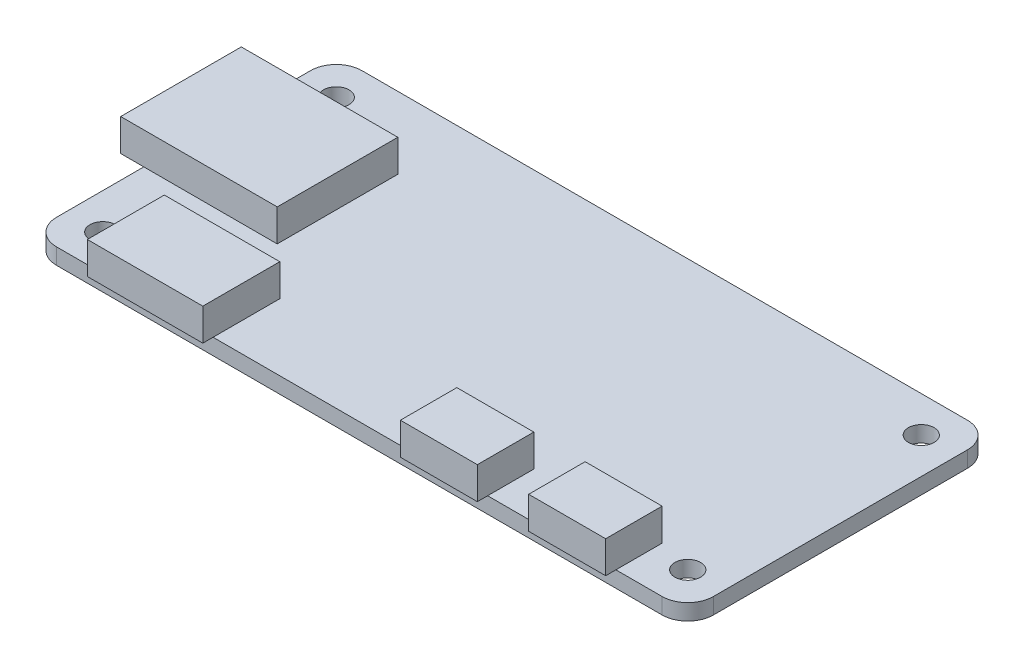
ISO-10303-21;
HEADER;
FILE_DESCRIPTION(('STEP AP214'),'2;1');
FILE_NAME('part.step','',(''),(''),'','','');
FILE_SCHEMA(('AUTOMOTIVE_DESIGN { 1 0 10303 214 1 1 1 1 }'));
ENDSEC;
DATA;
#1=APPLICATION_CONTEXT('core data for automotive mechanical design processes');
#2=APPLICATION_PROTOCOL_DEFINITION('international standard','automotive_design',2000,#1);
#3=PRODUCT_CONTEXT('',#1,'mechanical');
#4=PRODUCT('Part','Part','',(#3));
#5=PRODUCT_RELATED_PRODUCT_CATEGORY('part','',(#4));
#6=PRODUCT_DEFINITION_FORMATION('','',#4);
#7=PRODUCT_DEFINITION_CONTEXT('part definition',#1,'design');
#8=PRODUCT_DEFINITION('design','',#6,#7);
#9=PRODUCT_DEFINITION_SHAPE('','',#8);
#10=(LENGTH_UNIT() NAMED_UNIT(*) SI_UNIT(.MILLI.,.METRE.));
#11=(NAMED_UNIT(*) PLANE_ANGLE_UNIT() SI_UNIT($,.RADIAN.));
#12=(NAMED_UNIT(*) SI_UNIT($,.STERADIAN.) SOLID_ANGLE_UNIT());
#13=UNCERTAINTY_MEASURE_WITH_UNIT(LENGTH_MEASURE(1.E-05),#10,'distance_accuracy_value','');
#14=(GEOMETRIC_REPRESENTATION_CONTEXT(3) GLOBAL_UNCERTAINTY_ASSIGNED_CONTEXT((#13)) GLOBAL_UNIT_ASSIGNED_CONTEXT((#10,
#11,#12)) REPRESENTATION_CONTEXT('',''));
#15=CARTESIAN_POINT('',(0.,0.,0.));
#16=DIRECTION('',(0.,0.,1.));
#17=DIRECTION('',(1.,0.,0.));
#18=AXIS2_PLACEMENT_3D('',#15,#16,#17);
#19=CARTESIAN_POINT('',(2.54,1.5875,-2.54));
#20=DIRECTION('',(0.,-1.,0.));
#21=DIRECTION('',(0.,0.,-1.));
#22=AXIS2_PLACEMENT_3D('',#19,#20,#21);
#23=PLANE('',#22);
#24=CARTESIAN_POINT('',(3.556,1.5875,-26.67));
#25=DIRECTION('',(0.,1.,0.));
#26=DIRECTION('',(0.,0.,1.));
#27=AXIS2_PLACEMENT_3D('',#24,#25,#26);
#28=CIRCLE('',#27,1.27);
#29=CARTESIAN_POINT('',(3.556,1.5875,-25.4));
#30=VERTEX_POINT('',#29);
#31=EDGE_CURVE('E364',#30,#30,#28,.T.);
#32=ORIENTED_EDGE('',*,*,#31,.F.);
#33=EDGE_LOOP('',(#32));
#34=FACE_BOUND('',#33,.T.);
#35=CARTESIAN_POINT('',(3.556,1.5875,-3.556));
#36=DIRECTION('',(0.,1.,0.));
#37=DIRECTION('',(0.,0.,1.));
#38=AXIS2_PLACEMENT_3D('',#35,#36,#37);
#39=CIRCLE('',#38,1.27);
#40=CARTESIAN_POINT('',(3.556,1.5875,-2.286));
#41=VERTEX_POINT('',#40);
#42=EDGE_CURVE('E358',#41,#41,#39,.T.);
#43=ORIENTED_EDGE('',*,*,#42,.F.);
#44=EDGE_LOOP('',(#43));
#45=FACE_BOUND('',#44,.T.);
#46=CARTESIAN_POINT('',(61.468,1.5875,-3.556));
#47=DIRECTION('',(0.,1.,0.));
#48=DIRECTION('',(0.,0.,1.));
#49=AXIS2_PLACEMENT_3D('',#46,#47,#48);
#50=CIRCLE('',#49,1.26999999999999);
#51=CARTESIAN_POINT('',(61.468,1.5875,-2.28600000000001));
#52=VERTEX_POINT('',#51);
#53=EDGE_CURVE('E352',#52,#52,#50,.T.);
#54=ORIENTED_EDGE('',*,*,#53,.F.);
#55=EDGE_LOOP('',(#54));
#56=FACE_BOUND('',#55,.T.);
#57=CARTESIAN_POINT('',(61.468,1.5875,-26.67));
#58=DIRECTION('',(0.,1.,0.));
#59=DIRECTION('',(0.,0.,1.));
#60=AXIS2_PLACEMENT_3D('',#57,#58,#59);
#61=CIRCLE('',#60,1.26999999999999);
#62=CARTESIAN_POINT('',(61.468,1.5875,-25.4));
#63=VERTEX_POINT('',#62);
#64=EDGE_CURVE('E346',#63,#63,#61,.T.);
#65=ORIENTED_EDGE('',*,*,#64,.F.);
#66=EDGE_LOOP('',(#65));
#67=FACE_BOUND('',#66,.T.);
#68=DIRECTION('',(-1.,0.,0.));
#69=VECTOR('',#68,1.);
#70=CARTESIAN_POINT('',(13.208,1.5875,-23.114));
#71=LINE('',#70,#69);
#72=CARTESIAN_POINT('',(13.208,1.5875,-23.114));
#73=VERTEX_POINT('',#72);
#74=CARTESIAN_POINT('',(0.,1.5875,-23.114));
#75=VERTEX_POINT('',#74);
#76=EDGE_CURVE('E49',#73,#75,#71,.T.);
#77=ORIENTED_EDGE('',*,*,#76,.F.);
#78=DIRECTION('',(0.,0.,-1.));
#79=VECTOR('',#78,1.);
#80=CARTESIAN_POINT('',(13.208,1.5875,-23.114));
#81=LINE('',#80,#79);
#82=CARTESIAN_POINT('',(13.208,1.5875,-11.176));
#83=VERTEX_POINT('',#82);
#84=EDGE_CURVE('E54',#83,#73,#81,.T.);
#85=ORIENTED_EDGE('',*,*,#84,.F.);
#86=DIRECTION('',(1.,0.,0.));
#87=VECTOR('',#86,1.);
#88=CARTESIAN_POINT('',(13.208,1.5875,-11.176));
#89=LINE('',#88,#87);
#90=CARTESIAN_POINT('',(0.,1.5875,-11.176));
#91=VERTEX_POINT('',#90);
#92=EDGE_CURVE('E819',#91,#83,#89,.T.);
#93=ORIENTED_EDGE('',*,*,#92,.F.);
#94=DIRECTION('',(0.,0.,1.));
#95=VECTOR('',#94,1.);
#96=CARTESIAN_POINT('',(0.,1.5875,-2.54000000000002));
#97=LINE('',#96,#95);
#98=CARTESIAN_POINT('',(0.,1.5875,-2.54000000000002));
#99=VERTEX_POINT('',#98);
#100=EDGE_CURVE('E391',#91,#99,#97,.T.);
#101=ORIENTED_EDGE('',*,*,#100,.T.);
#102=CARTESIAN_POINT('',(2.54,1.5875,-2.54));
#103=DIRECTION('',(0.,1.,0.));
#104=DIRECTION('',(0.,0.,-1.));
#105=AXIS2_PLACEMENT_3D('',#102,#103,#104);
#106=CIRCLE('',#105,2.54);
#107=CARTESIAN_POINT('',(2.54000000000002,1.5875,0.));
#108=VERTEX_POINT('',#107);
#109=EDGE_CURVE('E370',#99,#108,#106,.T.);
#110=ORIENTED_EDGE('',*,*,#109,.T.);
#111=DIRECTION('',(1.,0.,0.));
#112=VECTOR('',#111,1.);
#113=CARTESIAN_POINT('',(2.54000000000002,1.5875,0.));
#114=LINE('',#113,#112);
#115=CARTESIAN_POINT('',(6.604,1.5875,0.));
#116=VERTEX_POINT('',#115);
#117=EDGE_CURVE('E375',#108,#116,#114,.T.);
#118=ORIENTED_EDGE('',*,*,#117,.T.);
#119=DIRECTION('',(0.,0.,1.));
#120=VECTOR('',#119,1.);
#121=CARTESIAN_POINT('',(6.604,1.5875,-6.604));
#122=LINE('',#121,#120);
#123=CARTESIAN_POINT('',(6.604,1.5875,-6.604));
#124=VERTEX_POINT('',#123);
#125=EDGE_CURVE('E243',#124,#116,#122,.T.);
#126=ORIENTED_EDGE('',*,*,#125,.F.);
#127=DIRECTION('',(-1.,0.,0.));
#128=VECTOR('',#127,1.);
#129=CARTESIAN_POINT('',(6.604,1.5875,-6.604));
#130=LINE('',#129,#128);
#131=CARTESIAN_POINT('',(18.034,1.5875,-6.604));
#132=VERTEX_POINT('',#131);
#133=EDGE_CURVE('E253',#132,#124,#130,.T.);
#134=ORIENTED_EDGE('',*,*,#133,.F.);
#135=DIRECTION('',(0.,0.,-1.));
#136=VECTOR('',#135,1.);
#137=CARTESIAN_POINT('',(18.034,1.5875,-6.604));
#138=LINE('',#137,#136);
#139=CARTESIAN_POINT('',(18.034,1.5875,0.));
#140=VERTEX_POINT('',#139);
#141=EDGE_CURVE('E263',#140,#132,#138,.T.);
#142=ORIENTED_EDGE('',*,*,#141,.F.);
#143=CARTESIAN_POINT('',(37.592,1.5875,0.));
#144=VERTEX_POINT('',#143);
#145=EDGE_CURVE('E380',#140,#144,#114,.T.);
#146=ORIENTED_EDGE('',*,*,#145,.T.);
#147=DIRECTION('',(0.,0.,1.));
#148=VECTOR('',#147,1.);
#149=CARTESIAN_POINT('',(37.592,1.5875,-4.572));
#150=LINE('',#149,#148);
#151=CARTESIAN_POINT('',(37.592,1.5875,-4.572));
#152=VERTEX_POINT('',#151);
#153=EDGE_CURVE('E292',#152,#144,#150,.T.);
#154=ORIENTED_EDGE('',*,*,#153,.F.);
#155=DIRECTION('',(-1.,0.,0.));
#156=VECTOR('',#155,1.);
#157=CARTESIAN_POINT('',(37.592,1.5875,-4.572));
#158=LINE('',#157,#156);
#159=CARTESIAN_POINT('',(45.212,1.5875,-4.572));
#160=VERTEX_POINT('',#159);
#161=EDGE_CURVE('E285',#160,#152,#158,.T.);
#162=ORIENTED_EDGE('',*,*,#161,.F.);
#163=DIRECTION('',(0.,0.,-1.));
#164=VECTOR('',#163,1.);
#165=CARTESIAN_POINT('',(45.212,1.5875,-4.572));
#166=LINE('',#165,#164);
#167=CARTESIAN_POINT('',(45.212,1.5875,0.));
#168=VERTEX_POINT('',#167);
#169=EDGE_CURVE('E297',#168,#160,#166,.T.);
#170=ORIENTED_EDGE('',*,*,#169,.F.);
#171=CARTESIAN_POINT('',(50.292,1.5875,0.));
#172=VERTEX_POINT('',#171);
#173=EDGE_CURVE('E460',#168,#172,#114,.T.);
#174=ORIENTED_EDGE('',*,*,#173,.T.);
#175=DIRECTION('',(0.,0.,1.));
#176=VECTOR('',#175,1.);
#177=CARTESIAN_POINT('',(50.292,1.5875,-4.572));
#178=LINE('',#177,#176);
#179=CARTESIAN_POINT('',(50.292,1.5875,-4.572));
#180=VERTEX_POINT('',#179);
#181=EDGE_CURVE('E326',#180,#172,#178,.T.);
#182=ORIENTED_EDGE('',*,*,#181,.F.);
#183=DIRECTION('',(-1.,0.,0.));
#184=VECTOR('',#183,1.);
#185=CARTESIAN_POINT('',(50.292,1.5875,-4.572));
#186=LINE('',#185,#184);
#187=CARTESIAN_POINT('',(57.912,1.5875,-4.572));
#188=VERTEX_POINT('',#187);
#189=EDGE_CURVE('E319',#188,#180,#186,.T.);
#190=ORIENTED_EDGE('',*,*,#189,.F.);
#191=DIRECTION('',(0.,0.,-1.));
#192=VECTOR('',#191,1.);
#193=CARTESIAN_POINT('',(57.912,1.5875,-4.572));
#194=LINE('',#193,#192);
#195=CARTESIAN_POINT('',(57.912,1.5875,0.));
#196=VERTEX_POINT('',#195);
#197=EDGE_CURVE('E11',#196,#188,#194,.T.);
#198=ORIENTED_EDGE('',*,*,#197,.F.);
#199=CARTESIAN_POINT('',(62.484,1.5875,0.));
#200=VERTEX_POINT('',#199);
#201=EDGE_CURVE('E373',#196,#200,#114,.T.);
#202=ORIENTED_EDGE('',*,*,#201,.T.);
#203=CARTESIAN_POINT('',(62.484,1.5875,-2.54));
#204=DIRECTION('',(0.,1.,0.));
#205=DIRECTION('',(0.,0.,1.));
#206=AXIS2_PLACEMENT_3D('',#203,#204,#205);
#207=CIRCLE('',#206,2.54);
#208=CARTESIAN_POINT('',(65.024,1.5875,-2.54000000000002));
#209=VERTEX_POINT('',#208);
#210=EDGE_CURVE('E378',#200,#209,#207,.T.);
#211=ORIENTED_EDGE('',*,*,#210,.T.);
#212=DIRECTION('',(0.,0.,-1.));
#213=VECTOR('',#212,1.);
#214=CARTESIAN_POINT('',(65.024,1.5875,-2.54000000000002));
#215=LINE('',#214,#213);
#216=CARTESIAN_POINT('',(65.024,1.5875,-27.686));
#217=VERTEX_POINT('',#216);
#218=EDGE_CURVE('E383',#209,#217,#215,.T.);
#219=ORIENTED_EDGE('',*,*,#218,.T.);
#220=CARTESIAN_POINT('',(62.484,1.5875,-27.686));
#221=DIRECTION('',(0.,1.,0.));
#222=DIRECTION('',(0.,0.,-1.));
#223=AXIS2_PLACEMENT_3D('',#220,#221,#222);
#224=CIRCLE('',#223,2.54);
#225=CARTESIAN_POINT('',(62.484,1.5875,-30.226));
#226=VERTEX_POINT('',#225);
#227=EDGE_CURVE('E385',#217,#226,#224,.T.);
#228=ORIENTED_EDGE('',*,*,#227,.T.);
#229=DIRECTION('',(-1.,0.,0.));
#230=VECTOR('',#229,1.);
#231=CARTESIAN_POINT('',(2.54000000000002,1.5875,-30.226));
#232=LINE('',#231,#230);
#233=CARTESIAN_POINT('',(2.54000000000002,1.5875,-30.226));
#234=VERTEX_POINT('',#233);
#235=EDGE_CURVE('E387',#226,#234,#232,.T.);
#236=ORIENTED_EDGE('',*,*,#235,.T.);
#237=CARTESIAN_POINT('',(2.54,1.5875,-27.686));
#238=DIRECTION('',(0.,1.,0.));
#239=DIRECTION('',(0.,0.,-1.));
#240=AXIS2_PLACEMENT_3D('',#237,#238,#239);
#241=CIRCLE('',#240,2.54);
#242=CARTESIAN_POINT('',(0.,1.5875,-27.686));
#243=VERTEX_POINT('',#242);
#244=EDGE_CURVE('E389',#234,#243,#241,.T.);
#245=ORIENTED_EDGE('',*,*,#244,.T.);
#246=EDGE_CURVE('E392',#243,#75,#97,.T.);
#247=ORIENTED_EDGE('',*,*,#246,.T.);
#248=EDGE_LOOP('',(#77,#85,#93,#101,#110,#118,#126,#134,#142,#146,#154,#162,#170,#174,#182,#190,
#198,#202,#211,#219,#228,#236,#245,#247));
#249=FACE_BOUND('',#248,.T.);
#250=ADVANCED_FACE('F32',(#34,#45,#56,#67,#249),#23,.F.);
#251=CARTESIAN_POINT('',(2.54,0.,-2.54));
#252=DIRECTION('',(0.,-1.,0.));
#253=DIRECTION('',(0.,0.,-1.));
#254=AXIS2_PLACEMENT_3D('',#251,#252,#253);
#255=PLANE('',#254);
#256=CARTESIAN_POINT('',(61.468,0.,-3.556));
#257=DIRECTION('',(0.,1.,0.));
#258=DIRECTION('',(0.,0.,1.));
#259=AXIS2_PLACEMENT_3D('',#256,#257,#258);
#260=CIRCLE('',#259,1.26999999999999);
#261=CARTESIAN_POINT('',(61.468,0.,-2.28600000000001));
#262=VERTEX_POINT('',#261);
#263=EDGE_CURVE('E349',#262,#262,#260,.T.);
#264=ORIENTED_EDGE('',*,*,#263,.T.);
#265=EDGE_LOOP('',(#264));
#266=FACE_BOUND('',#265,.T.);
#267=CARTESIAN_POINT('',(3.556,0.,-26.67));
#268=DIRECTION('',(0.,1.,0.));
#269=DIRECTION('',(0.,0.,1.));
#270=AXIS2_PLACEMENT_3D('',#267,#268,#269);
#271=CIRCLE('',#270,1.27);
#272=CARTESIAN_POINT('',(3.556,0.,-25.4));
#273=VERTEX_POINT('',#272);
#274=EDGE_CURVE('E361',#273,#273,#271,.T.);
#275=ORIENTED_EDGE('',*,*,#274,.T.);
#276=EDGE_LOOP('',(#275));
#277=FACE_BOUND('',#276,.T.);
#278=CARTESIAN_POINT('',(2.54,0.,-2.54));
#279=DIRECTION('',(0.,1.,0.));
#280=DIRECTION('',(0.,0.,-1.));
#281=AXIS2_PLACEMENT_3D('',#278,#279,#280);
#282=CIRCLE('',#281,2.54);
#283=CARTESIAN_POINT('',(0.,0.,-2.54000000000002));
#284=VERTEX_POINT('',#283);
#285=CARTESIAN_POINT('',(2.54000000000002,0.,0.));
#286=VERTEX_POINT('',#285);
#287=EDGE_CURVE('E367',#284,#286,#282,.T.);
#288=ORIENTED_EDGE('',*,*,#287,.F.);
#289=DIRECTION('',(0.,0.,1.));
#290=VECTOR('',#289,1.);
#291=CARTESIAN_POINT('',(0.,0.,-2.54000000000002));
#292=LINE('',#291,#290);
#293=CARTESIAN_POINT('',(0.,0.,-27.686));
#294=VERTEX_POINT('',#293);
#295=EDGE_CURVE('E374',#294,#284,#292,.T.);
#296=ORIENTED_EDGE('',*,*,#295,.F.);
#297=CARTESIAN_POINT('',(2.54,0.,-27.686));
#298=DIRECTION('',(0.,1.,0.));
#299=DIRECTION('',(0.,0.,-1.));
#300=AXIS2_PLACEMENT_3D('',#297,#298,#299);
#301=CIRCLE('',#300,2.54);
#302=CARTESIAN_POINT('',(2.54000000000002,0.,-30.226));
#303=VERTEX_POINT('',#302);
#304=EDGE_CURVE('E408',#303,#294,#301,.T.);
#305=ORIENTED_EDGE('',*,*,#304,.F.);
#306=DIRECTION('',(-1.,0.,0.));
#307=VECTOR('',#306,1.);
#308=CARTESIAN_POINT('',(2.54000000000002,0.,-30.226));
#309=LINE('',#308,#307);
#310=CARTESIAN_POINT('',(62.484,0.,-30.226));
#311=VERTEX_POINT('',#310);
#312=EDGE_CURVE('E406',#311,#303,#309,.T.);
#313=ORIENTED_EDGE('',*,*,#312,.F.);
#314=CARTESIAN_POINT('',(62.484,0.,-27.686));
#315=DIRECTION('',(0.,1.,0.));
#316=DIRECTION('',(0.,0.,-1.));
#317=AXIS2_PLACEMENT_3D('',#314,#315,#316);
#318=CIRCLE('',#317,2.54);
#319=CARTESIAN_POINT('',(65.024,0.,-27.686));
#320=VERTEX_POINT('',#319);
#321=EDGE_CURVE('E404',#320,#311,#318,.T.);
#322=ORIENTED_EDGE('',*,*,#321,.F.);
#323=DIRECTION('',(0.,0.,-1.));
#324=VECTOR('',#323,1.);
#325=CARTESIAN_POINT('',(65.024,0.,-2.54000000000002));
#326=LINE('',#325,#324);
#327=CARTESIAN_POINT('',(65.024,0.,-2.54000000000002));
#328=VERTEX_POINT('',#327);
#329=EDGE_CURVE('E402',#328,#320,#326,.T.);
#330=ORIENTED_EDGE('',*,*,#329,.F.);
#331=CARTESIAN_POINT('',(62.484,0.,-2.54));
#332=DIRECTION('',(0.,1.,0.));
#333=DIRECTION('',(0.,0.,1.));
#334=AXIS2_PLACEMENT_3D('',#331,#332,#333);
#335=CIRCLE('',#334,2.54);
#336=CARTESIAN_POINT('',(62.484,0.,0.));
#337=VERTEX_POINT('',#336);
#338=EDGE_CURVE('E400',#337,#328,#335,.T.);
#339=ORIENTED_EDGE('',*,*,#338,.F.);
#340=DIRECTION('',(1.,0.,0.));
#341=VECTOR('',#340,1.);
#342=CARTESIAN_POINT('',(2.54000000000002,0.,0.));
#343=LINE('',#342,#341);
#344=EDGE_CURVE('E398',#286,#337,#343,.T.);
#345=ORIENTED_EDGE('',*,*,#344,.F.);
#346=EDGE_LOOP('',(#288,#296,#305,#313,#322,#330,#339,#345));
#347=FACE_BOUND('',#346,.T.);
#348=CARTESIAN_POINT('',(3.556,0.,-3.556));
#349=DIRECTION('',(0.,1.,0.));
#350=DIRECTION('',(0.,0.,1.));
#351=AXIS2_PLACEMENT_3D('',#348,#349,#350);
#352=CIRCLE('',#351,1.27);
#353=CARTESIAN_POINT('',(3.556,0.,-2.286));
#354=VERTEX_POINT('',#353);
#355=EDGE_CURVE('E355',#354,#354,#352,.T.);
#356=ORIENTED_EDGE('',*,*,#355,.T.);
#357=EDGE_LOOP('',(#356));
#358=FACE_BOUND('',#357,.T.);
#359=CARTESIAN_POINT('',(61.468,0.,-26.67));
#360=DIRECTION('',(0.,1.,0.));
#361=DIRECTION('',(0.,0.,1.));
#362=AXIS2_PLACEMENT_3D('',#359,#360,#361);
#363=CIRCLE('',#362,1.26999999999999);
#364=CARTESIAN_POINT('',(61.468,0.,-25.4));
#365=VERTEX_POINT('',#364);
#366=EDGE_CURVE('E345',#365,#365,#363,.T.);
#367=ORIENTED_EDGE('',*,*,#366,.T.);
#368=EDGE_LOOP('',(#367));
#369=FACE_BOUND('',#368,.T.);
#370=ADVANCED_FACE('F443',(#266,#277,#347,#358,#369),#255,.T.);
#371=CARTESIAN_POINT('',(2.54,1.5875,-2.54));
#372=DIRECTION('',(0.,-1.,0.));
#373=DIRECTION('',(0.,0.,-1.));
#374=AXIS2_PLACEMENT_3D('',#371,#372,#373);
#375=CYLINDRICAL_SURFACE('',#374,2.54);
#376=ORIENTED_EDGE('',*,*,#287,.T.);
#377=DIRECTION('',(0.,-1.,0.));
#378=VECTOR('',#377,1.);
#379=CARTESIAN_POINT('',(2.54000000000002,1.5875,0.));
#380=LINE('',#379,#378);
#381=EDGE_CURVE('E36',#108,#286,#380,.T.);
#382=ORIENTED_EDGE('',*,*,#381,.F.);
#383=ORIENTED_EDGE('',*,*,#109,.F.);
#384=DIRECTION('',(0.,-1.,0.));
#385=VECTOR('',#384,1.);
#386=CARTESIAN_POINT('',(0.,1.5875,-2.54000000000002));
#387=LINE('',#386,#385);
#388=EDGE_CURVE('E394',#99,#284,#387,.T.);
#389=ORIENTED_EDGE('',*,*,#388,.T.);
#390=EDGE_LOOP('',(#376,#382,#383,#389));
#391=FACE_BOUND('',#390,.T.);
#392=ADVANCED_FACE('F34',(#391),#375,.T.);
#393=CARTESIAN_POINT('',(2.54000000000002,1.5875,0.));
#394=DIRECTION('',(0.,0.,-1.));
#395=DIRECTION('',(-1.,0.,0.));
#396=AXIS2_PLACEMENT_3D('',#393,#394,#395);
#397=PLANE('',#396);
#398=ORIENTED_EDGE('',*,*,#344,.T.);
#399=DIRECTION('',(0.,-1.,0.));
#400=VECTOR('',#399,1.);
#401=CARTESIAN_POINT('',(62.484,1.5875,0.));
#402=LINE('',#401,#400);
#403=EDGE_CURVE('E427',#200,#337,#402,.T.);
#404=ORIENTED_EDGE('',*,*,#403,.F.);
#405=ORIENTED_EDGE('',*,*,#201,.F.);
#406=EDGE_CURVE('E381',#172,#196,#114,.T.);
#407=ORIENTED_EDGE('',*,*,#406,.F.);
#408=ORIENTED_EDGE('',*,*,#173,.F.);
#409=EDGE_CURVE('E459',#144,#168,#114,.T.);
#410=ORIENTED_EDGE('',*,*,#409,.F.);
#411=ORIENTED_EDGE('',*,*,#145,.F.);
#412=EDGE_CURVE('E379',#116,#140,#114,.T.);
#413=ORIENTED_EDGE('',*,*,#412,.F.);
#414=ORIENTED_EDGE('',*,*,#117,.F.);
#415=ORIENTED_EDGE('',*,*,#381,.T.);
#416=EDGE_LOOP('',(#398,#404,#405,#407,#408,#410,#411,#413,#414,#415));
#417=FACE_BOUND('',#416,.T.);
#418=ADVANCED_FACE('F436',(#417),#397,.F.);
#419=CARTESIAN_POINT('',(62.484,1.5875,-2.54));
#420=DIRECTION('',(0.,-1.,0.));
#421=DIRECTION('',(0.,0.,-1.));
#422=AXIS2_PLACEMENT_3D('',#419,#420,#421);
#423=CYLINDRICAL_SURFACE('',#422,2.54);
#424=ORIENTED_EDGE('',*,*,#338,.T.);
#425=DIRECTION('',(0.,-1.,0.));
#426=VECTOR('',#425,1.);
#427=CARTESIAN_POINT('',(65.024,1.5875,-2.54000000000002));
#428=LINE('',#427,#426);
#429=EDGE_CURVE('E425',#209,#328,#428,.T.);
#430=ORIENTED_EDGE('',*,*,#429,.F.);
#431=ORIENTED_EDGE('',*,*,#210,.F.);
#432=ORIENTED_EDGE('',*,*,#403,.T.);
#433=EDGE_LOOP('',(#424,#430,#431,#432));
#434=FACE_BOUND('',#433,.T.);
#435=ADVANCED_FACE('F449',(#434),#423,.T.);
#436=CARTESIAN_POINT('',(65.024,1.5875,-2.54000000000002));
#437=DIRECTION('',(-1.,0.,0.));
#438=DIRECTION('',(0.,0.,1.));
#439=AXIS2_PLACEMENT_3D('',#436,#437,#438);
#440=PLANE('',#439);
#441=ORIENTED_EDGE('',*,*,#329,.T.);
#442=DIRECTION('',(0.,-1.,0.));
#443=VECTOR('',#442,1.);
#444=CARTESIAN_POINT('',(65.024,1.5875,-27.686));
#445=LINE('',#444,#443);
#446=EDGE_CURVE('E422',#217,#320,#445,.T.);
#447=ORIENTED_EDGE('',*,*,#446,.F.);
#448=ORIENTED_EDGE('',*,*,#218,.F.);
#449=ORIENTED_EDGE('',*,*,#429,.T.);
#450=EDGE_LOOP('',(#441,#447,#448,#449));
#451=FACE_BOUND('',#450,.T.);
#452=ADVANCED_FACE('F452',(#451),#440,.F.);
#453=CARTESIAN_POINT('',(62.484,1.5875,-27.686));
#454=DIRECTION('',(0.,-1.,0.));
#455=DIRECTION('',(0.,0.,-1.));
#456=AXIS2_PLACEMENT_3D('',#453,#454,#455);
#457=CYLINDRICAL_SURFACE('',#456,2.54);
#458=ORIENTED_EDGE('',*,*,#321,.T.);
#459=DIRECTION('',(0.,-1.,0.));
#460=VECTOR('',#459,1.);
#461=CARTESIAN_POINT('',(62.484,1.5875,-30.226));
#462=LINE('',#461,#460);
#463=EDGE_CURVE('E419',#226,#311,#462,.T.);
#464=ORIENTED_EDGE('',*,*,#463,.F.);
#465=ORIENTED_EDGE('',*,*,#227,.F.);
#466=ORIENTED_EDGE('',*,*,#446,.T.);
#467=EDGE_LOOP('',(#458,#464,#465,#466));
#468=FACE_BOUND('',#467,.T.);
#469=ADVANCED_FACE('F529',(#468),#457,.T.);
#470=CARTESIAN_POINT('',(2.54000000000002,1.5875,-30.226));
#471=DIRECTION('',(0.,0.,1.));
#472=DIRECTION('',(1.,0.,0.));
#473=AXIS2_PLACEMENT_3D('',#470,#471,#472);
#474=PLANE('',#473);
#475=ORIENTED_EDGE('',*,*,#312,.T.);
#476=DIRECTION('',(0.,-1.,0.));
#477=VECTOR('',#476,1.);
#478=CARTESIAN_POINT('',(2.54000000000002,1.5875,-30.226));
#479=LINE('',#478,#477);
#480=EDGE_CURVE('E416',#234,#303,#479,.T.);
#481=ORIENTED_EDGE('',*,*,#480,.F.);
#482=ORIENTED_EDGE('',*,*,#235,.F.);
#483=ORIENTED_EDGE('',*,*,#463,.T.);
#484=EDGE_LOOP('',(#475,#481,#482,#483));
#485=FACE_BOUND('',#484,.T.);
#486=ADVANCED_FACE('F525',(#485),#474,.F.);
#487=CARTESIAN_POINT('',(2.54,1.5875,-27.686));
#488=DIRECTION('',(0.,-1.,0.));
#489=DIRECTION('',(0.,0.,-1.));
#490=AXIS2_PLACEMENT_3D('',#487,#488,#489);
#491=CYLINDRICAL_SURFACE('',#490,2.54);
#492=ORIENTED_EDGE('',*,*,#304,.T.);
#493=DIRECTION('',(0.,-1.,0.));
#494=VECTOR('',#493,1.);
#495=CARTESIAN_POINT('',(0.,1.5875,-27.686));
#496=LINE('',#495,#494);
#497=EDGE_CURVE('E413',#243,#294,#496,.T.);
#498=ORIENTED_EDGE('',*,*,#497,.F.);
#499=ORIENTED_EDGE('',*,*,#244,.F.);
#500=ORIENTED_EDGE('',*,*,#480,.T.);
#501=EDGE_LOOP('',(#492,#498,#499,#500));
#502=FACE_BOUND('',#501,.T.);
#503=ADVANCED_FACE('F521',(#502),#491,.T.);
#504=CARTESIAN_POINT('',(0.,1.5875,-2.54000000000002));
#505=DIRECTION('',(1.,0.,0.));
#506=DIRECTION('',(0.,0.,-1.));
#507=AXIS2_PLACEMENT_3D('',#504,#505,#506);
#508=PLANE('',#507);
#509=ORIENTED_EDGE('',*,*,#295,.T.);
#510=ORIENTED_EDGE('',*,*,#388,.F.);
#511=ORIENTED_EDGE('',*,*,#100,.F.);
#512=EDGE_CURVE('E395',#75,#91,#97,.T.);
#513=ORIENTED_EDGE('',*,*,#512,.F.);
#514=ORIENTED_EDGE('',*,*,#246,.F.);
#515=ORIENTED_EDGE('',*,*,#497,.T.);
#516=EDGE_LOOP('',(#509,#510,#511,#513,#514,#515));
#517=FACE_BOUND('',#516,.T.);
#518=ADVANCED_FACE('F518',(#517),#508,.F.);
#519=CARTESIAN_POINT('',(3.556,1.5875,-26.67));
#520=DIRECTION('',(0.,-1.,0.));
#521=DIRECTION('',(0.,0.,-1.));
#522=AXIS2_PLACEMENT_3D('',#519,#520,#521);
#523=CYLINDRICAL_SURFACE('',#522,1.27);
#524=ORIENTED_EDGE('',*,*,#31,.T.);
#525=EDGE_LOOP('',(#524));
#526=FACE_BOUND('',#525,.T.);
#527=ORIENTED_EDGE('',*,*,#274,.F.);
#528=EDGE_LOOP('',(#527));
#529=FACE_BOUND('',#528,.T.);
#530=ADVANCED_FACE('F515',(#526,#529),#523,.F.);
#531=CARTESIAN_POINT('',(3.556,1.5875,-3.556));
#532=DIRECTION('',(0.,-1.,0.));
#533=DIRECTION('',(0.,0.,-1.));
#534=AXIS2_PLACEMENT_3D('',#531,#532,#533);
#535=CYLINDRICAL_SURFACE('',#534,1.27);
#536=ORIENTED_EDGE('',*,*,#42,.T.);
#537=EDGE_LOOP('',(#536));
#538=FACE_BOUND('',#537,.T.);
#539=ORIENTED_EDGE('',*,*,#355,.F.);
#540=EDGE_LOOP('',(#539));
#541=FACE_BOUND('',#540,.T.);
#542=ADVANCED_FACE('F594',(#538,#541),#535,.F.);
#543=CARTESIAN_POINT('',(61.468,1.5875,-3.556));
#544=DIRECTION('',(0.,-1.,0.));
#545=DIRECTION('',(0.,0.,-1.));
#546=AXIS2_PLACEMENT_3D('',#543,#544,#545);
#547=CYLINDRICAL_SURFACE('',#546,1.26999999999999);
#548=ORIENTED_EDGE('',*,*,#53,.T.);
#549=EDGE_LOOP('',(#548));
#550=FACE_BOUND('',#549,.T.);
#551=ORIENTED_EDGE('',*,*,#263,.F.);
#552=EDGE_LOOP('',(#551));
#553=FACE_BOUND('',#552,.T.);
#554=ADVANCED_FACE('F602',(#550,#553),#547,.F.);
#555=CARTESIAN_POINT('',(61.468,1.5875,-26.67));
#556=DIRECTION('',(0.,-1.,0.));
#557=DIRECTION('',(0.,0.,-1.));
#558=AXIS2_PLACEMENT_3D('',#555,#556,#557);
#559=CYLINDRICAL_SURFACE('',#558,1.26999999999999);
#560=ORIENTED_EDGE('',*,*,#64,.T.);
#561=EDGE_LOOP('',(#560));
#562=FACE_BOUND('',#561,.T.);
#563=ORIENTED_EDGE('',*,*,#366,.F.);
#564=EDGE_LOOP('',(#563));
#565=FACE_BOUND('',#564,.T.);
#566=ADVANCED_FACE('F610',(#562,#565),#559,.F.);
#567=CARTESIAN_POINT('',(0.,1.5875,0.));
#568=DIRECTION('',(0.,1.,0.));
#569=DIRECTION('',(0.,0.,1.));
#570=AXIS2_PLACEMENT_3D('',#567,#568,#569);
#571=PLANE('',#570);
#572=CARTESIAN_POINT('',(50.292,1.5875,1.016));
#573=VERTEX_POINT('',#572);
#574=EDGE_CURVE('E314',#172,#573,#178,.T.);
#575=ORIENTED_EDGE('',*,*,#574,.F.);
#576=ORIENTED_EDGE('',*,*,#406,.T.);
#577=CARTESIAN_POINT('',(57.912,1.5875,1.016));
#578=VERTEX_POINT('',#577);
#579=EDGE_CURVE('E42',#578,#196,#194,.T.);
#580=ORIENTED_EDGE('',*,*,#579,.F.);
#581=DIRECTION('',(1.,0.,0.));
#582=VECTOR('',#581,1.);
#583=CARTESIAN_POINT('',(50.292,1.5875,1.016));
#584=LINE('',#583,#582);
#585=EDGE_CURVE('E329',#573,#578,#584,.T.);
#586=ORIENTED_EDGE('',*,*,#585,.F.);
#587=EDGE_LOOP('',(#575,#576,#580,#586));
#588=FACE_BOUND('',#587,.T.);
#589=ADVANCED_FACE('F619',(#588),#571,.F.);
#590=CARTESIAN_POINT('',(50.292,4.7625,-4.572));
#591=DIRECTION('',(1.,0.,0.));
#592=DIRECTION('',(0.,0.,-1.));
#593=AXIS2_PLACEMENT_3D('',#590,#591,#592);
#594=PLANE('',#593);
#595=ORIENTED_EDGE('',*,*,#181,.T.);
#596=ORIENTED_EDGE('',*,*,#574,.T.);
#597=DIRECTION('',(0.,-1.,0.));
#598=VECTOR('',#597,1.);
#599=CARTESIAN_POINT('',(50.292,4.7625,1.016));
#600=LINE('',#599,#598);
#601=CARTESIAN_POINT('',(50.292,4.7625,1.016));
#602=VERTEX_POINT('',#601);
#603=EDGE_CURVE('E342',#602,#573,#600,.T.);
#604=ORIENTED_EDGE('',*,*,#603,.F.);
#605=DIRECTION('',(0.,0.,1.));
#606=VECTOR('',#605,1.);
#607=CARTESIAN_POINT('',(50.292,4.7625,-4.572));
#608=LINE('',#607,#606);
#609=CARTESIAN_POINT('',(50.292,4.7625,-4.572));
#610=VERTEX_POINT('',#609);
#611=EDGE_CURVE('E315',#610,#602,#608,.T.);
#612=ORIENTED_EDGE('',*,*,#611,.F.);
#613=DIRECTION('',(0.,-1.,0.));
#614=VECTOR('',#613,1.);
#615=CARTESIAN_POINT('',(50.292,4.7625,-4.572));
#616=LINE('',#615,#614);
#617=EDGE_CURVE('E325',#610,#180,#616,.T.);
#618=ORIENTED_EDGE('',*,*,#617,.T.);
#619=EDGE_LOOP('',(#595,#596,#604,#612,#618));
#620=FACE_BOUND('',#619,.T.);
#621=ADVANCED_FACE('F631',(#620),#594,.F.);
#622=CARTESIAN_POINT('',(50.292,4.7625,1.016));
#623=DIRECTION('',(0.,0.,-1.));
#624=DIRECTION('',(-1.,0.,0.));
#625=AXIS2_PLACEMENT_3D('',#622,#623,#624);
#626=PLANE('',#625);
#627=ORIENTED_EDGE('',*,*,#585,.T.);
#628=DIRECTION('',(0.,-1.,0.));
#629=VECTOR('',#628,1.);
#630=CARTESIAN_POINT('',(57.912,4.7625,1.016));
#631=LINE('',#630,#629);
#632=CARTESIAN_POINT('',(57.912,4.7625,1.016));
#633=VERTEX_POINT('',#632);
#634=EDGE_CURVE('E339',#633,#578,#631,.T.);
#635=ORIENTED_EDGE('',*,*,#634,.F.);
#636=DIRECTION('',(1.,0.,0.));
#637=VECTOR('',#636,1.);
#638=CARTESIAN_POINT('',(50.292,4.7625,1.016));
#639=LINE('',#638,#637);
#640=EDGE_CURVE('E318',#602,#633,#639,.T.);
#641=ORIENTED_EDGE('',*,*,#640,.F.);
#642=ORIENTED_EDGE('',*,*,#603,.T.);
#643=EDGE_LOOP('',(#627,#635,#641,#642));
#644=FACE_BOUND('',#643,.T.);
#645=ADVANCED_FACE('F640',(#644),#626,.F.);
#646=CARTESIAN_POINT('',(57.912,4.7625,-4.572));
#647=DIRECTION('',(-1.,0.,0.));
#648=DIRECTION('',(0.,0.,1.));
#649=AXIS2_PLACEMENT_3D('',#646,#647,#648);
#650=PLANE('',#649);
#651=ORIENTED_EDGE('',*,*,#579,.T.);
#652=ORIENTED_EDGE('',*,*,#197,.T.);
#653=DIRECTION('',(0.,-1.,0.));
#654=VECTOR('',#653,1.);
#655=CARTESIAN_POINT('',(57.912,4.7625,-4.572));
#656=LINE('',#655,#654);
#657=CARTESIAN_POINT('',(57.912,4.7625,-4.572));
#658=VERTEX_POINT('',#657);
#659=EDGE_CURVE('E336',#658,#188,#656,.T.);
#660=ORIENTED_EDGE('',*,*,#659,.F.);
#661=DIRECTION('',(0.,0.,-1.));
#662=VECTOR('',#661,1.);
#663=CARTESIAN_POINT('',(57.912,4.7625,-4.572));
#664=LINE('',#663,#662);
#665=EDGE_CURVE('E321',#633,#658,#664,.T.);
#666=ORIENTED_EDGE('',*,*,#665,.F.);
#667=ORIENTED_EDGE('',*,*,#634,.T.);
#668=EDGE_LOOP('',(#651,#652,#660,#666,#667));
#669=FACE_BOUND('',#668,.T.);
#670=ADVANCED_FACE('F649',(#669),#650,.F.);
#671=CARTESIAN_POINT('',(50.292,4.7625,-4.572));
#672=DIRECTION('',(0.,0.,1.));
#673=DIRECTION('',(1.,0.,0.));
#674=AXIS2_PLACEMENT_3D('',#671,#672,#673);
#675=PLANE('',#674);
#676=ORIENTED_EDGE('',*,*,#189,.T.);
#677=ORIENTED_EDGE('',*,*,#617,.F.);
#678=DIRECTION('',(-1.,0.,0.));
#679=VECTOR('',#678,1.);
#680=CARTESIAN_POINT('',(50.292,4.7625,-4.572));
#681=LINE('',#680,#679);
#682=EDGE_CURVE('E323',#658,#610,#681,.T.);
#683=ORIENTED_EDGE('',*,*,#682,.F.);
#684=ORIENTED_EDGE('',*,*,#659,.T.);
#685=EDGE_LOOP('',(#676,#677,#683,#684));
#686=FACE_BOUND('',#685,.T.);
#687=ADVANCED_FACE('F658',(#686),#675,.F.);
#688=CARTESIAN_POINT('',(0.,4.7625,0.));
#689=DIRECTION('',(0.,1.,0.));
#690=DIRECTION('',(0.,0.,1.));
#691=AXIS2_PLACEMENT_3D('',#688,#689,#690);
#692=PLANE('',#691);
#693=ORIENTED_EDGE('',*,*,#611,.T.);
#694=ORIENTED_EDGE('',*,*,#640,.T.);
#695=ORIENTED_EDGE('',*,*,#665,.T.);
#696=ORIENTED_EDGE('',*,*,#682,.T.);
#697=EDGE_LOOP('',(#693,#694,#695,#696));
#698=FACE_BOUND('',#697,.T.);
#699=ADVANCED_FACE('F667',(#698),#692,.T.);
#700=CARTESIAN_POINT('',(0.,1.5875,0.));
#701=DIRECTION('',(0.,1.,0.));
#702=DIRECTION('',(0.,0.,1.));
#703=AXIS2_PLACEMENT_3D('',#700,#701,#702);
#704=PLANE('',#703);
#705=CARTESIAN_POINT('',(37.592,1.5875,1.016));
#706=VERTEX_POINT('',#705);
#707=EDGE_CURVE('E280',#144,#706,#150,.T.);
#708=ORIENTED_EDGE('',*,*,#707,.F.);
#709=ORIENTED_EDGE('',*,*,#409,.T.);
#710=CARTESIAN_POINT('',(45.212,1.5875,1.016));
#711=VERTEX_POINT('',#710);
#712=EDGE_CURVE('E298',#711,#168,#166,.T.);
#713=ORIENTED_EDGE('',*,*,#712,.F.);
#714=DIRECTION('',(1.,0.,0.));
#715=VECTOR('',#714,1.);
#716=CARTESIAN_POINT('',(37.592,1.5875,1.016));
#717=LINE('',#716,#715);
#718=EDGE_CURVE('E295',#706,#711,#717,.T.);
#719=ORIENTED_EDGE('',*,*,#718,.F.);
#720=EDGE_LOOP('',(#708,#709,#713,#719));
#721=FACE_BOUND('',#720,.T.);
#722=ADVANCED_FACE('F676',(#721),#704,.F.);
#723=CARTESIAN_POINT('',(37.592,4.7625,-4.572));
#724=DIRECTION('',(1.,0.,0.));
#725=DIRECTION('',(0.,0.,-1.));
#726=AXIS2_PLACEMENT_3D('',#723,#724,#725);
#727=PLANE('',#726);
#728=ORIENTED_EDGE('',*,*,#153,.T.);
#729=ORIENTED_EDGE('',*,*,#707,.T.);
#730=DIRECTION('',(0.,-1.,0.));
#731=VECTOR('',#730,1.);
#732=CARTESIAN_POINT('',(37.592,4.7625,1.016));
#733=LINE('',#732,#731);
#734=CARTESIAN_POINT('',(37.592,4.7625,1.016));
#735=VERTEX_POINT('',#734);
#736=EDGE_CURVE('E311',#735,#706,#733,.T.);
#737=ORIENTED_EDGE('',*,*,#736,.F.);
#738=DIRECTION('',(0.,0.,1.));
#739=VECTOR('',#738,1.);
#740=CARTESIAN_POINT('',(37.592,4.7625,-4.572));
#741=LINE('',#740,#739);
#742=CARTESIAN_POINT('',(37.592,4.7625,-4.572));
#743=VERTEX_POINT('',#742);
#744=EDGE_CURVE('E281',#743,#735,#741,.T.);
#745=ORIENTED_EDGE('',*,*,#744,.F.);
#746=DIRECTION('',(0.,-1.,0.));
#747=VECTOR('',#746,1.);
#748=CARTESIAN_POINT('',(37.592,4.7625,-4.572));
#749=LINE('',#748,#747);
#750=EDGE_CURVE('E291',#743,#152,#749,.T.);
#751=ORIENTED_EDGE('',*,*,#750,.T.);
#752=EDGE_LOOP('',(#728,#729,#737,#745,#751));
#753=FACE_BOUND('',#752,.T.);
#754=ADVANCED_FACE('F685',(#753),#727,.F.);
#755=CARTESIAN_POINT('',(37.592,4.7625,1.016));
#756=DIRECTION('',(0.,0.,-1.));
#757=DIRECTION('',(-1.,0.,0.));
#758=AXIS2_PLACEMENT_3D('',#755,#756,#757);
#759=PLANE('',#758);
#760=ORIENTED_EDGE('',*,*,#718,.T.);
#761=DIRECTION('',(0.,-1.,0.));
#762=VECTOR('',#761,1.);
#763=CARTESIAN_POINT('',(45.212,4.7625,1.016));
#764=LINE('',#763,#762);
#765=CARTESIAN_POINT('',(45.212,4.7625,1.016));
#766=VERTEX_POINT('',#765);
#767=EDGE_CURVE('E308',#766,#711,#764,.T.);
#768=ORIENTED_EDGE('',*,*,#767,.F.);
#769=DIRECTION('',(1.,0.,0.));
#770=VECTOR('',#769,1.);
#771=CARTESIAN_POINT('',(37.592,4.7625,1.016));
#772=LINE('',#771,#770);
#773=EDGE_CURVE('E284',#735,#766,#772,.T.);
#774=ORIENTED_EDGE('',*,*,#773,.F.);
#775=ORIENTED_EDGE('',*,*,#736,.T.);
#776=EDGE_LOOP('',(#760,#768,#774,#775));
#777=FACE_BOUND('',#776,.T.);
#778=ADVANCED_FACE('F693',(#777),#759,.F.);
#779=CARTESIAN_POINT('',(45.212,4.7625,-4.572));
#780=DIRECTION('',(-1.,0.,0.));
#781=DIRECTION('',(0.,0.,1.));
#782=AXIS2_PLACEMENT_3D('',#779,#780,#781);
#783=PLANE('',#782);
#784=ORIENTED_EDGE('',*,*,#712,.T.);
#785=ORIENTED_EDGE('',*,*,#169,.T.);
#786=DIRECTION('',(0.,-1.,0.));
#787=VECTOR('',#786,1.);
#788=CARTESIAN_POINT('',(45.212,4.7625,-4.572));
#789=LINE('',#788,#787);
#790=CARTESIAN_POINT('',(45.212,4.7625,-4.572));
#791=VERTEX_POINT('',#790);
#792=EDGE_CURVE('E305',#791,#160,#789,.T.);
#793=ORIENTED_EDGE('',*,*,#792,.F.);
#794=DIRECTION('',(0.,0.,-1.));
#795=VECTOR('',#794,1.);
#796=CARTESIAN_POINT('',(45.212,4.7625,-4.572));
#797=LINE('',#796,#795);
#798=EDGE_CURVE('E287',#766,#791,#797,.T.);
#799=ORIENTED_EDGE('',*,*,#798,.F.);
#800=ORIENTED_EDGE('',*,*,#767,.T.);
#801=EDGE_LOOP('',(#784,#785,#793,#799,#800));
#802=FACE_BOUND('',#801,.T.);
#803=ADVANCED_FACE('F702',(#802),#783,.F.);
#804=CARTESIAN_POINT('',(37.592,4.7625,-4.572));
#805=DIRECTION('',(0.,0.,1.));
#806=DIRECTION('',(1.,0.,0.));
#807=AXIS2_PLACEMENT_3D('',#804,#805,#806);
#808=PLANE('',#807);
#809=ORIENTED_EDGE('',*,*,#161,.T.);
#810=ORIENTED_EDGE('',*,*,#750,.F.);
#811=DIRECTION('',(-1.,0.,0.));
#812=VECTOR('',#811,1.);
#813=CARTESIAN_POINT('',(37.592,4.7625,-4.572));
#814=LINE('',#813,#812);
#815=EDGE_CURVE('E289',#791,#743,#814,.T.);
#816=ORIENTED_EDGE('',*,*,#815,.F.);
#817=ORIENTED_EDGE('',*,*,#792,.T.);
#818=EDGE_LOOP('',(#809,#810,#816,#817));
#819=FACE_BOUND('',#818,.T.);
#820=ADVANCED_FACE('F711',(#819),#808,.F.);
#821=CARTESIAN_POINT('',(0.,4.7625,0.));
#822=DIRECTION('',(0.,1.,0.));
#823=DIRECTION('',(0.,0.,1.));
#824=AXIS2_PLACEMENT_3D('',#821,#822,#823);
#825=PLANE('',#824);
#826=ORIENTED_EDGE('',*,*,#744,.T.);
#827=ORIENTED_EDGE('',*,*,#773,.T.);
#828=ORIENTED_EDGE('',*,*,#798,.T.);
#829=ORIENTED_EDGE('',*,*,#815,.T.);
#830=EDGE_LOOP('',(#826,#827,#828,#829));
#831=FACE_BOUND('',#830,.T.);
#832=ADVANCED_FACE('F720',(#831),#825,.T.);
#833=CARTESIAN_POINT('',(0.,1.5875,0.));
#834=DIRECTION('',(0.,1.,0.));
#835=DIRECTION('',(0.,0.,1.));
#836=AXIS2_PLACEMENT_3D('',#833,#834,#835);
#837=PLANE('',#836);
#838=CARTESIAN_POINT('',(6.604,1.5875,1.016));
#839=VERTEX_POINT('',#838);
#840=EDGE_CURVE('E241',#116,#839,#122,.T.);
#841=ORIENTED_EDGE('',*,*,#840,.F.);
#842=ORIENTED_EDGE('',*,*,#412,.T.);
#843=CARTESIAN_POINT('',(18.034,1.5875,1.016));
#844=VERTEX_POINT('',#843);
#845=EDGE_CURVE('E264',#844,#140,#138,.T.);
#846=ORIENTED_EDGE('',*,*,#845,.F.);
#847=DIRECTION('',(1.,0.,0.));
#848=VECTOR('',#847,1.);
#849=CARTESIAN_POINT('',(6.604,1.5875,1.016));
#850=LINE('',#849,#848);
#851=EDGE_CURVE('E261',#839,#844,#850,.T.);
#852=ORIENTED_EDGE('',*,*,#851,.F.);
#853=EDGE_LOOP('',(#841,#842,#846,#852));
#854=FACE_BOUND('',#853,.T.);
#855=ADVANCED_FACE('F471',(#854),#837,.F.);
#856=CARTESIAN_POINT('',(6.604,4.7625,-6.604));
#857=DIRECTION('',(1.,0.,0.));
#858=DIRECTION('',(0.,0.,-1.));
#859=AXIS2_PLACEMENT_3D('',#856,#857,#858);
#860=PLANE('',#859);
#861=ORIENTED_EDGE('',*,*,#125,.T.);
#862=ORIENTED_EDGE('',*,*,#840,.T.);
#863=DIRECTION('',(0.,-1.,0.));
#864=VECTOR('',#863,1.);
#865=CARTESIAN_POINT('',(6.604,4.7625,1.016));
#866=LINE('',#865,#864);
#867=CARTESIAN_POINT('',(6.604,4.7625,1.016));
#868=VERTEX_POINT('',#867);
#869=EDGE_CURVE('E277',#868,#839,#866,.T.);
#870=ORIENTED_EDGE('',*,*,#869,.F.);
#871=DIRECTION('',(0.,0.,1.));
#872=VECTOR('',#871,1.);
#873=CARTESIAN_POINT('',(6.604,4.7625,-6.604));
#874=LINE('',#873,#872);
#875=CARTESIAN_POINT('',(6.604,4.7625,-6.604));
#876=VERTEX_POINT('',#875);
#877=EDGE_CURVE('E249',#876,#868,#874,.T.);
#878=ORIENTED_EDGE('',*,*,#877,.F.);
#879=DIRECTION('',(0.,-1.,0.));
#880=VECTOR('',#879,1.);
#881=CARTESIAN_POINT('',(6.604,4.7625,-6.604));
#882=LINE('',#881,#880);
#883=EDGE_CURVE('E258',#876,#124,#882,.T.);
#884=ORIENTED_EDGE('',*,*,#883,.T.);
#885=EDGE_LOOP('',(#861,#862,#870,#878,#884));
#886=FACE_BOUND('',#885,.T.);
#887=ADVANCED_FACE('F485',(#886),#860,.F.);
#888=CARTESIAN_POINT('',(6.604,4.7625,1.016));
#889=DIRECTION('',(0.,0.,-1.));
#890=DIRECTION('',(-1.,0.,0.));
#891=AXIS2_PLACEMENT_3D('',#888,#889,#890);
#892=PLANE('',#891);
#893=ORIENTED_EDGE('',*,*,#851,.T.);
#894=DIRECTION('',(0.,-1.,0.));
#895=VECTOR('',#894,1.);
#896=CARTESIAN_POINT('',(18.034,4.7625,1.016));
#897=LINE('',#896,#895);
#898=CARTESIAN_POINT('',(18.034,4.7625,1.016));
#899=VERTEX_POINT('',#898);
#900=EDGE_CURVE('E274',#899,#844,#897,.T.);
#901=ORIENTED_EDGE('',*,*,#900,.F.);
#902=DIRECTION('',(1.,0.,0.));
#903=VECTOR('',#902,1.);
#904=CARTESIAN_POINT('',(6.604,4.7625,1.016));
#905=LINE('',#904,#903);
#906=EDGE_CURVE('E252',#868,#899,#905,.T.);
#907=ORIENTED_EDGE('',*,*,#906,.F.);
#908=ORIENTED_EDGE('',*,*,#869,.T.);
#909=EDGE_LOOP('',(#893,#901,#907,#908));
#910=FACE_BOUND('',#909,.T.);
#911=ADVANCED_FACE('F481',(#910),#892,.F.);
#912=CARTESIAN_POINT('',(18.034,4.7625,-6.604));
#913=DIRECTION('',(-1.,0.,0.));
#914=DIRECTION('',(0.,0.,1.));
#915=AXIS2_PLACEMENT_3D('',#912,#913,#914);
#916=PLANE('',#915);
#917=ORIENTED_EDGE('',*,*,#845,.T.);
#918=ORIENTED_EDGE('',*,*,#141,.T.);
#919=DIRECTION('',(0.,-1.,0.));
#920=VECTOR('',#919,1.);
#921=CARTESIAN_POINT('',(18.034,4.7625,-6.604));
#922=LINE('',#921,#920);
#923=CARTESIAN_POINT('',(18.034,4.7625,-6.604));
#924=VERTEX_POINT('',#923);
#925=EDGE_CURVE('E271',#924,#132,#922,.T.);
#926=ORIENTED_EDGE('',*,*,#925,.F.);
#927=DIRECTION('',(0.,0.,-1.));
#928=VECTOR('',#927,1.);
#929=CARTESIAN_POINT('',(18.034,4.7625,-6.604));
#930=LINE('',#929,#928);
#931=EDGE_CURVE('E255',#899,#924,#930,.T.);
#932=ORIENTED_EDGE('',*,*,#931,.F.);
#933=ORIENTED_EDGE('',*,*,#900,.T.);
#934=EDGE_LOOP('',(#917,#918,#926,#932,#933));
#935=FACE_BOUND('',#934,.T.);
#936=ADVANCED_FACE('F475',(#935),#916,.F.);
#937=CARTESIAN_POINT('',(6.604,4.7625,-6.604));
#938=DIRECTION('',(0.,0.,1.));
#939=DIRECTION('',(1.,0.,0.));
#940=AXIS2_PLACEMENT_3D('',#937,#938,#939);
#941=PLANE('',#940);
#942=ORIENTED_EDGE('',*,*,#133,.T.);
#943=ORIENTED_EDGE('',*,*,#883,.F.);
#944=DIRECTION('',(-1.,0.,0.));
#945=VECTOR('',#944,1.);
#946=CARTESIAN_POINT('',(6.604,4.7625,-6.604));
#947=LINE('',#946,#945);
#948=EDGE_CURVE('E257',#924,#876,#947,.T.);
#949=ORIENTED_EDGE('',*,*,#948,.F.);
#950=ORIENTED_EDGE('',*,*,#925,.T.);
#951=EDGE_LOOP('',(#942,#943,#949,#950));
#952=FACE_BOUND('',#951,.T.);
#953=ADVANCED_FACE('F488',(#952),#941,.F.);
#954=CARTESIAN_POINT('',(0.,4.7625,0.));
#955=DIRECTION('',(0.,1.,0.));
#956=DIRECTION('',(0.,0.,1.));
#957=AXIS2_PLACEMENT_3D('',#954,#955,#956);
#958=PLANE('',#957);
#959=ORIENTED_EDGE('',*,*,#877,.T.);
#960=ORIENTED_EDGE('',*,*,#906,.T.);
#961=ORIENTED_EDGE('',*,*,#931,.T.);
#962=ORIENTED_EDGE('',*,*,#948,.T.);
#963=EDGE_LOOP('',(#959,#960,#961,#962));
#964=FACE_BOUND('',#963,.T.);
#965=ADVANCED_FACE('F491',(#964),#958,.T.);
#966=CARTESIAN_POINT('',(0.,1.5875,0.));
#967=DIRECTION('',(0.,-1.,0.));
#968=DIRECTION('',(0.,0.,-1.));
#969=AXIS2_PLACEMENT_3D('',#966,#967,#968);
#970=PLANE('',#969);
#971=ORIENTED_EDGE('',*,*,#512,.T.);
#972=CARTESIAN_POINT('',(-2.286,1.5875,-11.176));
#973=VERTEX_POINT('',#972);
#974=EDGE_CURVE('E238',#973,#91,#89,.T.);
#975=ORIENTED_EDGE('',*,*,#974,.F.);
#976=DIRECTION('',(0.,0.,1.));
#977=VECTOR('',#976,1.);
#978=CARTESIAN_POINT('',(-2.286,1.5875,-23.114));
#979=LINE('',#978,#977);
#980=CARTESIAN_POINT('',(-2.286,1.5875,-23.114));
#981=VERTEX_POINT('',#980);
#982=EDGE_CURVE('E824',#981,#973,#979,.T.);
#983=ORIENTED_EDGE('',*,*,#982,.F.);
#984=EDGE_CURVE('E832',#75,#981,#71,.T.);
#985=ORIENTED_EDGE('',*,*,#984,.F.);
#986=EDGE_LOOP('',(#971,#975,#983,#985));
#987=FACE_BOUND('',#986,.T.);
#988=ADVANCED_FACE('F493',(#987),#970,.T.);
#989=CARTESIAN_POINT('',(13.208,4.7625,-23.114));
#990=DIRECTION('',(-1.,0.,0.));
#991=DIRECTION('',(0.,0.,1.));
#992=AXIS2_PLACEMENT_3D('',#989,#990,#991);
#993=PLANE('',#992);
#994=ORIENTED_EDGE('',*,*,#84,.T.);
#995=DIRECTION('',(0.,-1.,0.));
#996=VECTOR('',#995,1.);
#997=CARTESIAN_POINT('',(13.208,4.7625,-23.114));
#998=LINE('',#997,#996);
#999=CARTESIAN_POINT('',(13.208,4.7625,-23.114));
#1000=VERTEX_POINT('',#999);
#1001=EDGE_CURVE('E223',#1000,#73,#998,.T.);
#1002=ORIENTED_EDGE('',*,*,#1001,.F.);
#1003=DIRECTION('',(0.,0.,-1.));
#1004=VECTOR('',#1003,1.);
#1005=CARTESIAN_POINT('',(13.208,4.7625,-23.114));
#1006=LINE('',#1005,#1004);
#1007=CARTESIAN_POINT('',(13.208,4.7625,-11.176));
#1008=VERTEX_POINT('',#1007);
#1009=EDGE_CURVE('E229',#1008,#1000,#1006,.T.);
#1010=ORIENTED_EDGE('',*,*,#1009,.F.);
#1011=DIRECTION('',(0.,-1.,0.));
#1012=VECTOR('',#1011,1.);
#1013=CARTESIAN_POINT('',(13.208,4.7625,-11.176));
#1014=LINE('',#1013,#1012);
#1015=EDGE_CURVE('E828',#1008,#83,#1014,.T.);
#1016=ORIENTED_EDGE('',*,*,#1015,.T.);
#1017=EDGE_LOOP('',(#994,#1002,#1010,#1016));
#1018=FACE_BOUND('',#1017,.T.);
#1019=ADVANCED_FACE('F240',(#1018),#993,.F.);
#1020=CARTESIAN_POINT('',(13.208,4.7625,-23.114));
#1021=DIRECTION('',(0.,0.,1.));
#1022=DIRECTION('',(1.,0.,0.));
#1023=AXIS2_PLACEMENT_3D('',#1020,#1021,#1022);
#1024=PLANE('',#1023);
#1025=ORIENTED_EDGE('',*,*,#76,.T.);
#1026=ORIENTED_EDGE('',*,*,#984,.T.);
#1027=DIRECTION('',(0.,-1.,0.));
#1028=VECTOR('',#1027,1.);
#1029=CARTESIAN_POINT('',(-2.286,4.7625,-23.114));
#1030=LINE('',#1029,#1028);
#1031=CARTESIAN_POINT('',(-2.286,4.7625,-23.114));
#1032=VERTEX_POINT('',#1031);
#1033=EDGE_CURVE('E225',#1032,#981,#1030,.T.);
#1034=ORIENTED_EDGE('',*,*,#1033,.F.);
#1035=DIRECTION('',(-1.,0.,0.));
#1036=VECTOR('',#1035,1.);
#1037=CARTESIAN_POINT('',(13.208,4.7625,-23.114));
#1038=LINE('',#1037,#1036);
#1039=EDGE_CURVE('E219',#1000,#1032,#1038,.T.);
#1040=ORIENTED_EDGE('',*,*,#1039,.F.);
#1041=ORIENTED_EDGE('',*,*,#1001,.T.);
#1042=EDGE_LOOP('',(#1025,#1026,#1034,#1040,#1041));
#1043=FACE_BOUND('',#1042,.T.);
#1044=ADVANCED_FACE('F221',(#1043),#1024,.F.);
#1045=CARTESIAN_POINT('',(-2.286,4.7625,-23.114));
#1046=DIRECTION('',(1.,0.,0.));
#1047=DIRECTION('',(0.,0.,-1.));
#1048=AXIS2_PLACEMENT_3D('',#1045,#1046,#1047);
#1049=PLANE('',#1048);
#1050=ORIENTED_EDGE('',*,*,#982,.T.);
#1051=DIRECTION('',(0.,-1.,0.));
#1052=VECTOR('',#1051,1.);
#1053=CARTESIAN_POINT('',(-2.286,4.7625,-11.176));
#1054=LINE('',#1053,#1052);
#1055=CARTESIAN_POINT('',(-2.286,4.7625,-11.176));
#1056=VERTEX_POINT('',#1055);
#1057=EDGE_CURVE('E245',#1056,#973,#1054,.T.);
#1058=ORIENTED_EDGE('',*,*,#1057,.F.);
#1059=DIRECTION('',(0.,0.,1.));
#1060=VECTOR('',#1059,1.);
#1061=CARTESIAN_POINT('',(-2.286,4.7625,-23.114));
#1062=LINE('',#1061,#1060);
#1063=EDGE_CURVE('E228',#1032,#1056,#1062,.T.);
#1064=ORIENTED_EDGE('',*,*,#1063,.F.);
#1065=ORIENTED_EDGE('',*,*,#1033,.T.);
#1066=EDGE_LOOP('',(#1050,#1058,#1064,#1065));
#1067=FACE_BOUND('',#1066,.T.);
#1068=ADVANCED_FACE('F784',(#1067),#1049,.F.);
#1069=CARTESIAN_POINT('',(13.208,4.7625,-11.176));
#1070=DIRECTION('',(0.,0.,-1.));
#1071=DIRECTION('',(-1.,0.,0.));
#1072=AXIS2_PLACEMENT_3D('',#1069,#1070,#1071);
#1073=PLANE('',#1072);
#1074=ORIENTED_EDGE('',*,*,#974,.T.);
#1075=ORIENTED_EDGE('',*,*,#92,.T.);
#1076=ORIENTED_EDGE('',*,*,#1015,.F.);
#1077=DIRECTION('',(1.,0.,0.));
#1078=VECTOR('',#1077,1.);
#1079=CARTESIAN_POINT('',(13.208,4.7625,-11.176));
#1080=LINE('',#1079,#1078);
#1081=EDGE_CURVE('E234',#1056,#1008,#1080,.T.);
#1082=ORIENTED_EDGE('',*,*,#1081,.F.);
#1083=ORIENTED_EDGE('',*,*,#1057,.T.);
#1084=EDGE_LOOP('',(#1074,#1075,#1076,#1082,#1083));
#1085=FACE_BOUND('',#1084,.T.);
#1086=ADVANCED_FACE('F792',(#1085),#1073,.F.);
#1087=CARTESIAN_POINT('',(0.,4.7625,0.));
#1088=DIRECTION('',(0.,-1.,0.));
#1089=DIRECTION('',(0.,0.,-1.));
#1090=AXIS2_PLACEMENT_3D('',#1087,#1088,#1089);
#1091=PLANE('',#1090);
#1092=ORIENTED_EDGE('',*,*,#1009,.T.);
#1093=ORIENTED_EDGE('',*,*,#1039,.T.);
#1094=ORIENTED_EDGE('',*,*,#1063,.T.);
#1095=ORIENTED_EDGE('',*,*,#1081,.T.);
#1096=EDGE_LOOP('',(#1092,#1093,#1094,#1095));
#1097=FACE_BOUND('',#1096,.T.);
#1098=ADVANCED_FACE('F232',(#1097),#1091,.F.);
#1099=CLOSED_SHELL('',(#250,#370,#392,#418,#435,#452,#469,#486,#503,#518,#530,#542,#554,#566,
#589,#621,#645,#670,#687,#699,#722,#754,#778,#803,#820,#832,#855,#887,#911,#936,#953,#965,#988,
#1019,#1044,#1068,#1086,#1098));
#1100=MANIFOLD_SOLID_BREP('B2',#1099);
#1101=ADVANCED_BREP_SHAPE_REPRESENTATION('',(#18,#1100),#14);
#1102=SHAPE_DEFINITION_REPRESENTATION(#9,#1101);
ENDSEC;
END-ISO-10303-21;
